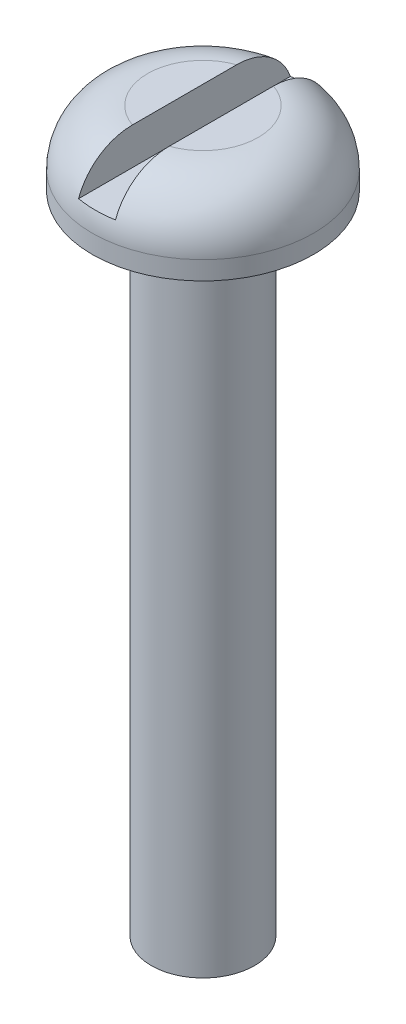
ISO-10303-21;
HEADER;
FILE_DESCRIPTION(('STEP AP214'),'2;1');
FILE_NAME('part.step','',(''),(''),'','','');
FILE_SCHEMA(('AUTOMOTIVE_DESIGN { 1 0 10303 214 1 1 1 1 }'));
ENDSEC;
DATA;
#1=APPLICATION_CONTEXT('core data for automotive mechanical design processes');
#2=APPLICATION_PROTOCOL_DEFINITION('international standard','automotive_design',2000,#1);
#3=PRODUCT_CONTEXT('',#1,'mechanical');
#4=PRODUCT('Part','Part','',(#3));
#5=PRODUCT_RELATED_PRODUCT_CATEGORY('part','',(#4));
#6=PRODUCT_DEFINITION_FORMATION('','',#4);
#7=PRODUCT_DEFINITION_CONTEXT('part definition',#1,'design');
#8=PRODUCT_DEFINITION('design','',#6,#7);
#9=PRODUCT_DEFINITION_SHAPE('','',#8);
#10=(LENGTH_UNIT() NAMED_UNIT(*) SI_UNIT(.MILLI.,.METRE.));
#11=(NAMED_UNIT(*) PLANE_ANGLE_UNIT() SI_UNIT($,.RADIAN.));
#12=(NAMED_UNIT(*) SI_UNIT($,.STERADIAN.) SOLID_ANGLE_UNIT());
#13=UNCERTAINTY_MEASURE_WITH_UNIT(LENGTH_MEASURE(1.E-05),#10,'distance_accuracy_value','');
#14=(GEOMETRIC_REPRESENTATION_CONTEXT(3) GLOBAL_UNCERTAINTY_ASSIGNED_CONTEXT((#13)) GLOBAL_UNIT_ASSIGNED_CONTEXT((#10,
#11,#12)) REPRESENTATION_CONTEXT('',''));
#15=CARTESIAN_POINT('',(0.,0.,0.));
#16=DIRECTION('',(0.,0.,1.));
#17=DIRECTION('',(1.,0.,0.));
#18=AXIS2_PLACEMENT_3D('',#15,#16,#17);
#19=CARTESIAN_POINT('',(-2.99999999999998,10.4,0.));
#20=DIRECTION('',(0.,1.,0.));
#21=DIRECTION('',(0.,0.,1.));
#22=AXIS2_PLACEMENT_3D('',#19,#20,#21);
#23=PLANE('',#22);
#24=DIRECTION('',(0.,0.,1.));
#25=VECTOR('',#24,1.);
#26=CARTESIAN_POINT('',(-1.,10.4,0.));
#27=LINE('',#26,#25);
#28=CARTESIAN_POINT('',(-1.,10.4,-2.82842712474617));
#29=VERTEX_POINT('',#28);
#30=CARTESIAN_POINT('',(-1.,10.4,2.82842712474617));
#31=VERTEX_POINT('',#30);
#32=EDGE_CURVE('E53',#29,#31,#27,.T.);
#33=ORIENTED_EDGE('',*,*,#32,.F.);
#34=CARTESIAN_POINT('',(0.,10.4,0.));
#35=DIRECTION('',(0.,1.,0.));
#36=DIRECTION('',(0.,0.,1.));
#37=AXIS2_PLACEMENT_3D('',#34,#35,#36);
#38=CIRCLE('',#37,2.99999999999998);
#39=EDGE_CURVE('E88',#29,#31,#38,.T.);
#40=ORIENTED_EDGE('',*,*,#39,.T.);
#41=EDGE_LOOP('',(#33,#40));
#42=FACE_BOUND('',#41,.T.);
#43=ADVANCED_FACE('F26',(#42),#23,.T.);
#44=CARTESIAN_POINT('',(0.,-28.6,0.));
#45=DIRECTION('',(0.,1.,0.));
#46=DIRECTION('',(0.,0.,1.));
#47=AXIS2_PLACEMENT_3D('',#44,#45,#46);
#48=CYLINDRICAL_SURFACE('',#47,2.8);
#49=CARTESIAN_POINT('',(0.,-28.6,0.));
#50=DIRECTION('',(0.,1.,0.));
#51=DIRECTION('',(0.,0.,1.));
#52=AXIS2_PLACEMENT_3D('',#49,#50,#51);
#53=CIRCLE('',#52,2.8);
#54=CARTESIAN_POINT('',(0.,-28.6,2.8));
#55=VERTEX_POINT('',#54);
#56=EDGE_CURVE('E79',#55,#55,#53,.T.);
#57=ORIENTED_EDGE('',*,*,#56,.T.);
#58=EDGE_LOOP('',(#57));
#59=FACE_BOUND('',#58,.T.);
#60=CARTESIAN_POINT('',(0.,6.4,0.));
#61=DIRECTION('',(0.,1.,0.));
#62=DIRECTION('',(0.,0.,1.));
#63=AXIS2_PLACEMENT_3D('',#60,#61,#62);
#64=CIRCLE('',#63,2.8);
#65=CARTESIAN_POINT('',(0.,6.4,2.8));
#66=VERTEX_POINT('',#65);
#67=EDGE_CURVE('E103',#66,#66,#64,.T.);
#68=ORIENTED_EDGE('',*,*,#67,.F.);
#69=EDGE_LOOP('',(#68));
#70=FACE_BOUND('',#69,.T.);
#71=ADVANCED_FACE('F28',(#59,#70),#48,.T.);
#72=CARTESIAN_POINT('',(0.,-28.6,0.));
#73=DIRECTION('',(0.,1.,0.));
#74=DIRECTION('',(0.,0.,1.));
#75=AXIS2_PLACEMENT_3D('',#72,#73,#74);
#76=PLANE('',#75);
#77=ORIENTED_EDGE('',*,*,#56,.F.);
#78=EDGE_LOOP('',(#77));
#79=FACE_BOUND('',#78,.T.);
#80=ADVANCED_FACE('F116',(#79),#76,.F.);
#81=DIRECTION('',(0.,0.,-1.));
#82=VECTOR('',#81,1.);
#83=CARTESIAN_POINT('',(1.,10.4,0.));
#84=LINE('',#83,#82);
#85=CARTESIAN_POINT('',(1.,10.4,2.82842712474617));
#86=VERTEX_POINT('',#85);
#87=CARTESIAN_POINT('',(1.,10.4,-2.82842712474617));
#88=VERTEX_POINT('',#87);
#89=EDGE_CURVE('E96',#86,#88,#84,.T.);
#90=ORIENTED_EDGE('',*,*,#89,.F.);
#91=EDGE_CURVE('E101',#86,#88,#38,.T.);
#92=ORIENTED_EDGE('',*,*,#91,.T.);
#93=EDGE_LOOP('',(#90,#92));
#94=FACE_BOUND('',#93,.T.);
#95=ADVANCED_FACE('F100',(#94),#23,.T.);
#96=CARTESIAN_POINT('',(0.,7.4,0.));
#97=DIRECTION('',(0.,1.,0.));
#98=DIRECTION('',(0.,0.,1.));
#99=AXIS2_PLACEMENT_3D('',#96,#97,#98);
#100=DEGENERATE_TOROIDAL_SURFACE('',#99,3.,3.,.T.);
#101=CARTESIAN_POINT('',(-1.,9.63606797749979,0.));
#102=CARTESIAN_POINT('',(-1.,9.63606832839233,0.0347573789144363));
#103=CARTESIAN_POINT('',(-1.,9.63770284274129,0.0695160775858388));
#104=CARTESIAN_POINT('',(-1.,9.64408287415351,0.138755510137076));
#105=CARTESIAN_POINT('',(-1.,9.6488301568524,0.173236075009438));
#106=CARTESIAN_POINT('',(-1.,9.66716719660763,0.276081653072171));
#107=CARTESIAN_POINT('',(-1.,9.68484951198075,0.343712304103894));
#108=CARTESIAN_POINT('',(-1.,9.71717923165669,0.4461027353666));
#109=CARTESIAN_POINT('',(-1.,9.72948627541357,0.48168390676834));
#110=CARTESIAN_POINT('',(-1.,9.75545837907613,0.552350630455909));
#111=CARTESIAN_POINT('',(-1.,9.76912329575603,0.587436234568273));
#112=CARTESIAN_POINT('',(-1.,9.81145913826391,0.692267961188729));
#113=CARTESIAN_POINT('',(-1.,9.84143179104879,0.761475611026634));
#114=CARTESIAN_POINT('',(-1.,9.90253859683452,0.900503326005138));
#115=CARTESIAN_POINT('',(-1.,9.93368307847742,0.970318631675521));
#116=CARTESIAN_POINT('',(-1.,9.99499645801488,1.11038321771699));
#117=CARTESIAN_POINT('',(-1.,10.0251653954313,1.18063248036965));
#118=CARTESIAN_POINT('',(-1.,10.0833182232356,1.32194271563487));
#119=CARTESIAN_POINT('',(-1.,10.1113046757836,1.39300262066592));
#120=CARTESIAN_POINT('',(-1.,10.164299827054,1.53623261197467));
#121=CARTESIAN_POINT('',(-1.,10.1893085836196,1.6084026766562));
#122=CARTESIAN_POINT('',(-1.,10.2355782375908,1.75344944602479));
#123=CARTESIAN_POINT('',(-1.,10.2568615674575,1.82631892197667));
#124=CARTESIAN_POINT('',(-1.,10.2953971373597,1.97311635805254));
#125=CARTESIAN_POINT('',(-1.,10.3126491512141,2.04704437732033));
#126=CARTESIAN_POINT('',(-1.,10.3577711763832,2.27017730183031));
#127=CARTESIAN_POINT('',(-1.,10.3790271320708,2.42079171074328));
#128=CARTESIAN_POINT('',(-1.,10.4038018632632,2.75165591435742));
#129=CARTESIAN_POINT('',(-1.,10.4033074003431,2.9322290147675));
#130=CARTESIAN_POINT('',(-1.,10.3725931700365,3.29154287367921));
#131=CARTESIAN_POINT('',(-1.,10.3422683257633,3.47027489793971));
#132=CARTESIAN_POINT('',(-1.,10.2514159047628,3.82025138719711));
#133=CARTESIAN_POINT('',(-1.,10.1908401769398,3.99148344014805));
#134=CARTESIAN_POINT('',(-1.,10.0406941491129,4.32048796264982));
#135=CARTESIAN_POINT('',(-1.,9.95116388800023,4.47827864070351));
#136=CARTESIAN_POINT('',(-1.,9.74943602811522,4.76974559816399));
#137=CARTESIAN_POINT('',(-1.,9.63823763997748,4.90411388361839));
#138=CARTESIAN_POINT('',(-1.,9.39426259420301,5.15168172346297));
#139=CARTESIAN_POINT('',(-1.,9.26148081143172,5.26487623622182));
#140=CARTESIAN_POINT('',(-1.,8.98205370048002,5.46375896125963));
#141=CARTESIAN_POINT('',(-1.,8.83587335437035,5.55010106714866));
#142=CARTESIAN_POINT('',(-1.,8.53097970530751,5.69666959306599));
#143=CARTESIAN_POINT('',(-1.,8.37226882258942,5.75690104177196));
#144=CARTESIAN_POINT('',(-1.,8.0488196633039,5.8488888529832));
#145=CARTESIAN_POINT('',(-1.,7.88417400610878,5.88097116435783));
#146=CARTESIAN_POINT('',(-1.,7.55182648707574,5.91690424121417));
#147=CARTESIAN_POINT('',(-1.,7.38412463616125,5.92075510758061));
#148=CARTESIAN_POINT('',(-1.,7.05121938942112,5.90015560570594));
#149=CARTESIAN_POINT('',(-1.,6.8860082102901,5.87583071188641));
#150=CARTESIAN_POINT('',(-1.,6.56201500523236,5.7998066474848));
#151=CARTESIAN_POINT('',(-1.,6.403232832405,5.74810810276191));
#152=CARTESIAN_POINT('',(-1.,6.09646302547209,5.61881807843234));
#153=CARTESIAN_POINT('',(-1.,5.94848281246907,5.5412089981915));
#154=CARTESIAN_POINT('',(-1.,5.66754684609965,5.36238488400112));
#155=CARTESIAN_POINT('',(-1.,5.53459196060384,5.26116848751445));
#156=CARTESIAN_POINT('',(-1.,5.28656849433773,5.0373998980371));
#157=CARTESIAN_POINT('',(-1.,5.17161437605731,4.91472090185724));
#158=CARTESIAN_POINT('',(-1.,4.96362987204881,4.65205748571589));
#159=CARTESIAN_POINT('',(-1.,4.87059580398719,4.51207597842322));
#160=CARTESIAN_POINT('',(-1.,4.70756140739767,4.21678709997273));
#161=CARTESIAN_POINT('',(-1.,4.63789724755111,4.06129462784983));
#162=CARTESIAN_POINT('',(-1.,4.52478348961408,3.74086162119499));
#163=CARTESIAN_POINT('',(-1.,4.48135615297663,3.57591319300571));
#164=CARTESIAN_POINT('',(-1.,4.43577628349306,3.32243719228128));
#165=CARTESIAN_POINT('',(-1.,4.42381973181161,3.23554798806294));
#166=CARTESIAN_POINT('',(-1.,4.40692467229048,3.06107219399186));
#167=CARTESIAN_POINT('',(-1.,4.40198614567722,2.9734856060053));
#168=CARTESIAN_POINT('',(-1.,4.39899729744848,2.79845997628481));
#169=CARTESIAN_POINT('',(-1.,4.40092695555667,2.71102124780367));
#170=CARTESIAN_POINT('',(-1.,4.4113882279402,2.53654048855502));
#171=CARTESIAN_POINT('',(-1.,4.41992057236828,2.44949850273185));
#172=CARTESIAN_POINT('',(-1.,4.44825139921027,2.23923553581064));
#173=CARTESIAN_POINT('',(-1.,4.47130585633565,2.1164462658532));
#174=CARTESIAN_POINT('',(-1.,4.52883714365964,1.87359527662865));
#175=CARTESIAN_POINT('',(-1.,4.56331696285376,1.75353427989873));
#176=CARTESIAN_POINT('',(-1.,4.62221533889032,1.5752245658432));
#177=CARTESIAN_POINT('',(-1.,4.64316696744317,1.51579395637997));
#178=CARTESIAN_POINT('',(-1.,4.68707482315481,1.3976767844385));
#179=CARTESIAN_POINT('',(-1.,4.71003106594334,1.33899022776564));
#180=CARTESIAN_POINT('',(-1.,4.75748504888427,1.22225948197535));
#181=CARTESIAN_POINT('',(-1.,4.78198258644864,1.1642152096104));
#182=CARTESIAN_POINT('',(-1.,4.83191739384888,1.04852857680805));
#183=CARTESIAN_POINT('',(-1.,4.85735476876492,0.990886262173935));
#184=CARTESIAN_POINT('',(-1.,4.90965439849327,0.872679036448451));
#185=CARTESIAN_POINT('',(-1.,4.93652245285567,0.8121167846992));
#186=CARTESIAN_POINT('',(-1.,4.98900952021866,0.69036779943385));
#187=CARTESIAN_POINT('',(-1.,5.01462730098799,0.629180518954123));
#188=CARTESIAN_POINT('',(-1.,5.06212726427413,0.506340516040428));
#189=CARTESIAN_POINT('',(-1.,5.08405778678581,0.444707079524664));
#190=CARTESIAN_POINT('',(-1.,5.12154538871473,0.31954596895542));
#191=CARTESIAN_POINT('',(-1.,5.13711852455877,0.256023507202));
#192=CARTESIAN_POINT('',(-1.,5.15343419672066,0.157569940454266));
#193=CARTESIAN_POINT('',(-1.,5.15770699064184,0.123230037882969));
#194=CARTESIAN_POINT('',(-1.,5.16313641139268,0.0542936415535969));
#195=CARTESIAN_POINT('',(-1.,5.16429281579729,0.0196971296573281));
#196=CARTESIAN_POINT('',(-1.,5.16337290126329,-0.0494804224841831));
#197=CARTESIAN_POINT('',(-1.,5.16129388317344,-0.0840614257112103));
#198=CARTESIAN_POINT('',(-1.,5.15409804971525,-0.152894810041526));
#199=CARTESIAN_POINT('',(-1.,5.14898131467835,-0.187147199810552));
#200=CARTESIAN_POINT('',(-1.,5.13015334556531,-0.286751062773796));
#201=CARTESIAN_POINT('',(-1.,5.11287417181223,-0.351418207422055));
#202=CARTESIAN_POINT('',(-1.,5.07230890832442,-0.478851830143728));
#203=CARTESIAN_POINT('',(-1.,5.04900843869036,-0.541613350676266));
#204=CARTESIAN_POINT('',(-1.,4.99913520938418,-0.66673541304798));
#205=CARTESIAN_POINT('',(-1.,4.97252384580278,-0.729080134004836));
#206=CARTESIAN_POINT('',(-1.,4.91836683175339,-0.853282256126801));
#207=CARTESIAN_POINT('',(-1.,4.89082205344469,-0.915140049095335));
#208=CARTESIAN_POINT('',(-1.,4.83624958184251,-1.0387807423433));
#209=CARTESIAN_POINT('',(-1.,4.80922021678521,-1.10056288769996));
#210=CARTESIAN_POINT('',(-1.,4.75648944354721,-1.22468685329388));
#211=CARTESIAN_POINT('',(-1.,4.73078784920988,-1.28702859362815));
#212=CARTESIAN_POINT('',(-1.,4.68138225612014,-1.41249925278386));
#213=CARTESIAN_POINT('',(-1.,4.65767803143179,-1.47562808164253));
#214=CARTESIAN_POINT('',(-1.,4.61276045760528,-1.60279691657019));
#215=CARTESIAN_POINT('',(-1.,4.59154824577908,-1.66683732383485));
#216=CARTESIAN_POINT('',(-1.,4.53266048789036,-1.85908765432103));
#217=CARTESIAN_POINT('',(-1.,4.49923620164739,-1.98864724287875));
#218=CARTESIAN_POINT('',(-1.,4.446117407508,-2.25057624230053));
#219=CARTESIAN_POINT('',(-1.,4.42641891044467,-2.38294482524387));
#220=CARTESIAN_POINT('',(-1.,4.40605842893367,-2.60646426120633));
#221=CARTESIAN_POINT('',(-1.,4.40132276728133,-2.69725619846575));
#222=CARTESIAN_POINT('',(-1.,4.39915855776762,-2.8789254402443));
#223=CARTESIAN_POINT('',(-1.,4.40172874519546,-2.96980272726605));
#224=CARTESIAN_POINT('',(-1.,4.41439313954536,-3.15129057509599));
#225=CARTESIAN_POINT('',(-1.,4.4245083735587,-3.24189967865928));
#226=CARTESIAN_POINT('',(-1.,4.45238465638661,-3.4219422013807));
#227=CARTESIAN_POINT('',(-1.,4.47014599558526,-3.511375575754));
#228=CARTESIAN_POINT('',(-1.,4.51335690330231,-3.68854041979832));
#229=CARTESIAN_POINT('',(-1.,4.53882028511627,-3.77626852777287));
#230=CARTESIAN_POINT('',(-1.,4.59734508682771,-3.94919111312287));
#231=CARTESIAN_POINT('',(-1.,4.63040939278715,-4.03438461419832));
#232=CARTESIAN_POINT('',(-1.,4.70391999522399,-4.20141723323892));
#233=CARTESIAN_POINT('',(-1.,4.74435770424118,-4.28326011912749));
#234=CARTESIAN_POINT('',(-1.,4.83237615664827,-4.44302016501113));
#235=CARTESIAN_POINT('',(-1.,4.8799594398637,-4.52093591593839));
#236=CARTESIAN_POINT('',(-1.,5.02827020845,-4.74081279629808));
#237=CARTESIAN_POINT('',(-1.,5.138074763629,-4.87681149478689));
#238=CARTESIAN_POINT('',(-1.,5.3795008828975,-5.12771781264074));
#239=CARTESIAN_POINT('',(-1.,5.51112232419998,-5.24262555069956));
#240=CARTESIAN_POINT('',(-1.,5.78847892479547,-5.44496493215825));
#241=CARTESIAN_POINT('',(-1.,5.93372445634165,-5.53306721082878));
#242=CARTESIAN_POINT('',(-1.,6.23707199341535,-5.68328014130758));
#243=CARTESIAN_POINT('',(-1.,6.39517242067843,-5.74539397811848));
#244=CARTESIAN_POINT('',(-1.,6.71768010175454,-5.84117013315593));
#245=CARTESIAN_POINT('',(-1.,6.88198785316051,-5.87516773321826));
#246=CARTESIAN_POINT('',(-1.,7.2139841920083,-5.91495403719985));
#247=CARTESIAN_POINT('',(-1.,7.38167269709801,-5.92074342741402));
#248=CARTESIAN_POINT('',(-1.,7.71484518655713,-5.90398074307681));
#249=CARTESIAN_POINT('',(-1.,7.88033578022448,-5.88155963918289));
#250=CARTESIAN_POINT('',(-1.,8.20520274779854,-5.80926441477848));
#251=CARTESIAN_POINT('',(-1.,8.36457923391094,-5.75939079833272));
#252=CARTESIAN_POINT('',(-1.,8.67280611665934,-5.63363023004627));
#253=CARTESIAN_POINT('',(-1.,8.82165106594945,-5.55772993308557));
#254=CARTESIAN_POINT('',(-1.,9.1045853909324,-5.38215097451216));
#255=CARTESIAN_POINT('',(-1.,9.23867399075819,-5.28247106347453));
#256=CARTESIAN_POINT('',(-1.,9.48917755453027,-5.06159008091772));
#257=CARTESIAN_POINT('',(-1.,9.60548349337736,-4.94026541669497));
#258=CARTESIAN_POINT('',(-1.,9.81637064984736,-4.68006511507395));
#259=CARTESIAN_POINT('',(-1.,9.91095512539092,-4.54119211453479));
#260=CARTESIAN_POINT('',(-1.,10.0772293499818,-4.24788414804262));
#261=CARTESIAN_POINT('',(-1.,10.1485929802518,-4.09326449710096));
#262=CARTESIAN_POINT('',(-1.,10.2651975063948,-3.77437481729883));
#263=CARTESIAN_POINT('',(-1.,10.3104184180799,-3.61009751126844));
#264=CARTESIAN_POINT('',(-1.,10.3751522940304,-3.27138430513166));
#265=CARTESIAN_POINT('',(-1.,10.3938375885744,-3.0967913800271));
#266=CARTESIAN_POINT('',(-1.,10.4035552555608,-2.7473165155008));
#267=CARTESIAN_POINT('',(-1.,10.3946547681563,-2.57243631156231));
#268=CARTESIAN_POINT('',(-1.,10.3580215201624,-2.27781817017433));
#269=CARTESIAN_POINT('',(-1.,10.3367107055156,-2.15721771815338));
#270=CARTESIAN_POINT('',(-1.,10.2829450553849,-1.9185127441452));
#271=CARTESIAN_POINT('',(-1.,10.2504874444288,-1.80040885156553));
#272=CARTESIAN_POINT('',(-1.,10.1759154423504,-1.56619947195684));
#273=CARTESIAN_POINT('',(-1.,10.133717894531,-1.45012102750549));
#274=CARTESIAN_POINT('',(-1.,10.0654960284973,-1.27803012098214));
#275=CARTESIAN_POINT('',(-1.,10.0419365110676,-1.22100864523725));
#276=CARTESIAN_POINT('',(-1.,9.99370728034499,-1.10742790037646));
#277=CARTESIAN_POINT('',(-1.,9.96903741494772,-1.05086869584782));
#278=CARTESIAN_POINT('',(-1.,9.91532500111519,-0.928972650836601));
#279=CARTESIAN_POINT('',(-1.,9.88621026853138,-0.863668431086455));
#280=CARTESIAN_POINT('',(-1.,9.82893394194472,-0.73252369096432));
#281=CARTESIAN_POINT('',(-1.,9.80077368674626,-0.66668256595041));
#282=CARTESIAN_POINT('',(-1.,9.74820261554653,-0.534431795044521));
#283=CARTESIAN_POINT('',(-1.,9.72374927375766,-0.468039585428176));
#284=CARTESIAN_POINT('',(-1.,9.6818989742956,-0.333081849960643));
#285=CARTESIAN_POINT('',(-1.,9.6644808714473,-0.264523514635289));
#286=CARTESIAN_POINT('',(-1.,9.64735225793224,-0.162811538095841));
#287=CARTESIAN_POINT('',(-1.,9.64315574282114,-0.130420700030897));
#288=CARTESIAN_POINT('',(-1.,9.63751175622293,-0.0653538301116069));
#289=CARTESIAN_POINT('',(-1.,9.63606764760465,-0.0326774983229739));
#290=CARTESIAN_POINT('',(-1.,9.63606797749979,0.));
#291=B_SPLINE_CURVE_WITH_KNOTS('',3,(#101,#102,#103,#104,#105,#106,#107,#108,#109,#110,#111,
#112,#113,#114,#115,#116,#117,#118,#119,#120,#121,#122,#123,#124,#125,#126,#127,#128,#129,#130,
#131,#132,#133,#134,#135,#136,#137,#138,#139,#140,#141,#142,#143,#144,#145,#146,#147,#148,#149,
#150,#151,#152,#153,#154,#155,#156,#157,#158,#159,#160,#161,#162,#163,#164,#165,#166,#167,#168,
#169,#170,#171,#172,#173,#174,#175,#176,#177,#178,#179,#180,#181,#182,#183,#184,#185,#186,#187,
#188,#189,#190,#191,#192,#193,#194,#195,#196,#197,#198,#199,#200,#201,#202,#203,#204,#205,#206,
#207,#208,#209,#210,#211,#212,#213,#214,#215,#216,#217,#218,#219,#220,#221,#222,#223,#224,#225,
#226,#227,#228,#229,#230,#231,#232,#233,#234,#235,#236,#237,#238,#239,#240,#241,#242,#243,#244,
#245,#246,#247,#248,#249,#250,#251,#252,#253,#254,#255,#256,#257,#258,#259,#260,#261,#262,#263,
#264,#265,#266,#267,#268,#269,#270,#271,#272,#273,#274,#275,#276,#277,#278,#279,#280,#281,#282,
#283,#284,#285,#286,#287,#288,#289,#290),.UNSPECIFIED.,.T.,.F.,(4,2,2,2,2,2,2,2,2,2,2,2,2,2,2,2,
2,2,2,2,2,2,2,2,2,2,2,2,2,2,2,2,2,2,2,2,2,2,2,2,2,2,2,2,2,2,2,2,2,2,2,2,2,2,2,2,2,2,2,2,2,2,2,2,
2,2,2,2,2,2,2,2,2,2,2,2,2,2,2,2,2,2,2,2,2,2,2,2,2,2,2,2,2,2,4),(0.,0.104237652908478,
0.208534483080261,0.417537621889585,0.530480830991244,0.643412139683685,0.869634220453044,
1.09898354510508,1.32832356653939,1.55739016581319,1.78645231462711,2.01408380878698,
2.2417280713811,2.69682624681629,3.23619534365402,3.77747118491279,4.31961134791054,
4.86100501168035,5.38166842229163,5.9024556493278,6.40933371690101,6.91611412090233,
7.41694580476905,7.91777569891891,8.41638380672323,8.91498051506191,9.41391660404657,
9.91288149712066,10.4149005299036,10.9168351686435,11.425707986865,11.935011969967,
12.1978990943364,12.4607855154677,12.7229062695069,12.9850560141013,13.3592114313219,
13.7334648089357,13.9224808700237,14.1114984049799,14.3004911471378,14.4895050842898,
14.6882714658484,14.8872299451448,15.0833327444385,15.2789371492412,15.3826261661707,
15.4863225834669,15.5901055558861,15.6938857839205,15.8941229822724,16.0948428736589,
16.2981722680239,16.5013166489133,16.7036178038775,16.9058905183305,17.1081403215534,
17.3104820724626,17.7112243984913,18.1118502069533,18.384330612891,18.6567638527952,
18.9299591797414,19.2031648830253,19.476863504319,19.750666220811,20.0241520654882,
20.297735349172,20.8192967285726,21.3408551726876,21.848022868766,22.3551283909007,
22.8560958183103,23.3570510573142,23.8556891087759,24.3543180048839,24.8532029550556,
25.352114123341,25.853971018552,26.3557525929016,26.8643043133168,27.3732442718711,
27.8977339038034,28.4209480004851,28.7878210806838,29.1547855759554,29.5250072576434,
29.7100892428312,29.8951966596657,30.1097037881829,30.3245002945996,30.5366077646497,
30.7480728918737,30.8459534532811,30.9439535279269),.UNSPECIFIED.);
#292=CARTESIAN_POINT('',(-1.,8.39519293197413,5.74372035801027));
#293=VERTEX_POINT('',#292);
#294=EDGE_CURVE('E11',#31,#293,#291,.T.);
#295=ORIENTED_EDGE('',*,*,#294,.F.);
#296=ORIENTED_EDGE('',*,*,#39,.F.);
#297=CARTESIAN_POINT('',(-1.,8.39519293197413,-5.74372035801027));
#298=VERTEX_POINT('',#297);
#299=EDGE_CURVE('E30',#298,#29,#291,.T.);
#300=ORIENTED_EDGE('',*,*,#299,.F.);
#301=CARTESIAN_POINT('',(0.,8.39519293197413,0.));
#302=DIRECTION('',(0.,-1.,0.));
#303=DIRECTION('',(0.,0.,-1.));
#304=AXIS2_PLACEMENT_3D('',#301,#302,#303);
#305=CIRCLE('',#304,5.83012208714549);
#306=CARTESIAN_POINT('',(1.,8.39519293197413,-5.74372035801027));
#307=VERTEX_POINT('',#306);
#308=EDGE_CURVE('E70',#307,#298,#305,.F.);
#309=ORIENTED_EDGE('',*,*,#308,.F.);
#310=CARTESIAN_POINT('',(1.,9.63606797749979,0.));
#311=CARTESIAN_POINT('',(1.,9.63606832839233,-0.0347573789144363));
#312=CARTESIAN_POINT('',(1.,9.63770284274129,-0.0695160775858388));
#313=CARTESIAN_POINT('',(1.,9.64408287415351,-0.138755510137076));
#314=CARTESIAN_POINT('',(1.,9.6488301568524,-0.173236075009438));
#315=CARTESIAN_POINT('',(1.,9.66716719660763,-0.276081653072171));
#316=CARTESIAN_POINT('',(1.,9.68484951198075,-0.343712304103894));
#317=CARTESIAN_POINT('',(1.,9.71717923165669,-0.4461027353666));
#318=CARTESIAN_POINT('',(1.,9.72948627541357,-0.48168390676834));
#319=CARTESIAN_POINT('',(1.,9.75545837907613,-0.55235063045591));
#320=CARTESIAN_POINT('',(1.,9.76912329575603,-0.587436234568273));
#321=CARTESIAN_POINT('',(1.,9.81145913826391,-0.69226796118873));
#322=CARTESIAN_POINT('',(1.,9.84143179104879,-0.761475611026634));
#323=CARTESIAN_POINT('',(1.,9.90253859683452,-0.900503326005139));
#324=CARTESIAN_POINT('',(1.,9.93368307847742,-0.970318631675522));
#325=CARTESIAN_POINT('',(1.,9.99499645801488,-1.11038321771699));
#326=CARTESIAN_POINT('',(1.,10.0251653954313,-1.18063248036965));
#327=CARTESIAN_POINT('',(1.,10.0833182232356,-1.32194271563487));
#328=CARTESIAN_POINT('',(1.,10.1113046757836,-1.39300262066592));
#329=CARTESIAN_POINT('',(1.,10.164299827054,-1.53623261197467));
#330=CARTESIAN_POINT('',(1.,10.1893085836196,-1.6084026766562));
#331=CARTESIAN_POINT('',(1.,10.2355782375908,-1.75344944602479));
#332=CARTESIAN_POINT('',(1.,10.2568615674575,-1.82631892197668));
#333=CARTESIAN_POINT('',(1.,10.2953971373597,-1.97311635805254));
#334=CARTESIAN_POINT('',(1.,10.3126491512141,-2.04704437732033));
#335=CARTESIAN_POINT('',(1.,10.3577711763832,-2.27017730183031));
#336=CARTESIAN_POINT('',(1.,10.3790271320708,-2.42079171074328));
#337=CARTESIAN_POINT('',(1.,10.4038018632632,-2.75165591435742));
#338=CARTESIAN_POINT('',(1.,10.4033074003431,-2.93222901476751));
#339=CARTESIAN_POINT('',(1.,10.3725931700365,-3.29154287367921));
#340=CARTESIAN_POINT('',(1.,10.3422683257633,-3.47027489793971));
#341=CARTESIAN_POINT('',(1.,10.2514159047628,-3.82025138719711));
#342=CARTESIAN_POINT('',(1.,10.1908401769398,-3.99148344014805));
#343=CARTESIAN_POINT('',(1.,10.0406941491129,-4.32048796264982));
#344=CARTESIAN_POINT('',(1.,9.95116388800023,-4.47827864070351));
#345=CARTESIAN_POINT('',(1.,9.74943602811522,-4.76974559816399));
#346=CARTESIAN_POINT('',(1.,9.63823763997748,-4.90411388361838));
#347=CARTESIAN_POINT('',(1.,9.39426259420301,-5.15168172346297));
#348=CARTESIAN_POINT('',(1.,9.26148081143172,-5.26487623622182));
#349=CARTESIAN_POINT('',(1.,8.98205370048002,-5.46375896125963));
#350=CARTESIAN_POINT('',(1.,8.83587335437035,-5.55010106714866));
#351=CARTESIAN_POINT('',(1.,8.53097970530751,-5.69666959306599));
#352=CARTESIAN_POINT('',(1.,8.37226882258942,-5.75690104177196));
#353=CARTESIAN_POINT('',(1.,8.0488196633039,-5.8488888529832));
#354=CARTESIAN_POINT('',(1.,7.88417400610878,-5.88097116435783));
#355=CARTESIAN_POINT('',(1.,7.55182648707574,-5.91690424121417));
#356=CARTESIAN_POINT('',(1.,7.38412463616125,-5.92075510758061));
#357=CARTESIAN_POINT('',(1.,7.05121938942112,-5.90015560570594));
#358=CARTESIAN_POINT('',(1.,6.8860082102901,-5.87583071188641));
#359=CARTESIAN_POINT('',(1.,6.56201500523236,-5.7998066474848));
#360=CARTESIAN_POINT('',(1.,6.403232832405,-5.74810810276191));
#361=CARTESIAN_POINT('',(1.,6.09646302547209,-5.61881807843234));
#362=CARTESIAN_POINT('',(1.,5.94848281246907,-5.5412089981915));
#363=CARTESIAN_POINT('',(1.,5.66754684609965,-5.36238488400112));
#364=CARTESIAN_POINT('',(1.,5.53459196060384,-5.26116848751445));
#365=CARTESIAN_POINT('',(1.,5.28656849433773,-5.0373998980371));
#366=CARTESIAN_POINT('',(1.,5.17161437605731,-4.91472090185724));
#367=CARTESIAN_POINT('',(1.,4.96362987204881,-4.6520574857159));
#368=CARTESIAN_POINT('',(1.,4.87059580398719,-4.51207597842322));
#369=CARTESIAN_POINT('',(1.,4.70756140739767,-4.21678709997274));
#370=CARTESIAN_POINT('',(1.,4.63789724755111,-4.06129462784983));
#371=CARTESIAN_POINT('',(1.,4.52478348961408,-3.74086162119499));
#372=CARTESIAN_POINT('',(1.,4.48135615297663,-3.57591319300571));
#373=CARTESIAN_POINT('',(1.,4.43577628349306,-3.32243719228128));
#374=CARTESIAN_POINT('',(1.,4.42381973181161,-3.23554798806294));
#375=CARTESIAN_POINT('',(1.,4.40692467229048,-3.06107219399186));
#376=CARTESIAN_POINT('',(1.,4.40198614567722,-2.9734856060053));
#377=CARTESIAN_POINT('',(1.,4.39899729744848,-2.79845997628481));
#378=CARTESIAN_POINT('',(1.,4.40092695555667,-2.71102124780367));
#379=CARTESIAN_POINT('',(1.,4.4113882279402,-2.53654048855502));
#380=CARTESIAN_POINT('',(1.,4.41992057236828,-2.44949850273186));
#381=CARTESIAN_POINT('',(1.,4.44825139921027,-2.23923553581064));
#382=CARTESIAN_POINT('',(1.,4.47130585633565,-2.1164462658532));
#383=CARTESIAN_POINT('',(1.,4.52883714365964,-1.87359527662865));
#384=CARTESIAN_POINT('',(1.,4.56331696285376,-1.75353427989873));
#385=CARTESIAN_POINT('',(1.,4.62221533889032,-1.57522456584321));
#386=CARTESIAN_POINT('',(1.,4.64316696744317,-1.51579395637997));
#387=CARTESIAN_POINT('',(1.,4.6870748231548,-1.3976767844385));
#388=CARTESIAN_POINT('',(1.,4.71003106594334,-1.33899022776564));
#389=CARTESIAN_POINT('',(1.,4.75748504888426,-1.22225948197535));
#390=CARTESIAN_POINT('',(1.,4.78198258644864,-1.16421520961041));
#391=CARTESIAN_POINT('',(1.,4.83191739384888,-1.04852857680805));
#392=CARTESIAN_POINT('',(1.,4.85735476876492,-0.990886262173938));
#393=CARTESIAN_POINT('',(1.,4.90965439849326,-0.872679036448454));
#394=CARTESIAN_POINT('',(1.,4.93652245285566,-0.812116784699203));
#395=CARTESIAN_POINT('',(1.,4.98900952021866,-0.690367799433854));
#396=CARTESIAN_POINT('',(1.,5.01462730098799,-0.629180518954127));
#397=CARTESIAN_POINT('',(1.,5.06212726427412,-0.506340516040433));
#398=CARTESIAN_POINT('',(1.,5.08405778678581,-0.444707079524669));
#399=CARTESIAN_POINT('',(1.,5.12154538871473,-0.319545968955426));
#400=CARTESIAN_POINT('',(1.,5.13711852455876,-0.256023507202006));
#401=CARTESIAN_POINT('',(1.,5.15343419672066,-0.157569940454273));
#402=CARTESIAN_POINT('',(1.,5.15770699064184,-0.123230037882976));
#403=CARTESIAN_POINT('',(1.,5.16313641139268,-0.054293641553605));
#404=CARTESIAN_POINT('',(1.,5.16429281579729,-0.0196971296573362));
#405=CARTESIAN_POINT('',(1.,5.16337290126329,0.0494804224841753));
#406=CARTESIAN_POINT('',(1.,5.16129388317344,0.0840614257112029));
#407=CARTESIAN_POINT('',(1.,5.15409804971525,0.152894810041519));
#408=CARTESIAN_POINT('',(1.,5.14898131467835,0.187147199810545));
#409=CARTESIAN_POINT('',(1.,5.13015334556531,0.28675106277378));
#410=CARTESIAN_POINT('',(1.,5.11287417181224,0.351418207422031));
#411=CARTESIAN_POINT('',(1.,5.07230890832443,0.478851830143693));
#412=CARTESIAN_POINT('',(1.,5.04900843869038,0.541613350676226));
#413=CARTESIAN_POINT('',(1.,4.9991352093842,0.666735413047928));
#414=CARTESIAN_POINT('',(1.,4.97252384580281,0.729080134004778));
#415=CARTESIAN_POINT('',(1.,4.91836683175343,0.85328225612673));
#416=CARTESIAN_POINT('',(1.,4.89082205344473,0.915140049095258));
#417=CARTESIAN_POINT('',(1.,4.83624958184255,1.03878074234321));
#418=CARTESIAN_POINT('',(1.,4.80922021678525,1.10056288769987));
#419=CARTESIAN_POINT('',(1.,4.75648944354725,1.22468685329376));
#420=CARTESIAN_POINT('',(1.,4.73078784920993,1.28702859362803));
#421=CARTESIAN_POINT('',(1.,4.68138225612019,1.41249925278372));
#422=CARTESIAN_POINT('',(1.,4.65767803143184,1.47562808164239));
#423=CARTESIAN_POINT('',(1.,4.61276045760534,1.60279691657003));
#424=CARTESIAN_POINT('',(1.,4.59154824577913,1.66683732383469));
#425=CARTESIAN_POINT('',(1.,4.53266048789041,1.85908765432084));
#426=CARTESIAN_POINT('',(1.,4.49923620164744,1.98864724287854));
#427=CARTESIAN_POINT('',(1.,4.44611740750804,2.2505762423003));
#428=CARTESIAN_POINT('',(1.,4.4264189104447,2.38294482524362));
#429=CARTESIAN_POINT('',(1.,4.40605842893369,2.60646426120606));
#430=CARTESIAN_POINT('',(1.,4.40132276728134,2.69725619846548));
#431=CARTESIAN_POINT('',(1.,4.39915855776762,2.87892544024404));
#432=CARTESIAN_POINT('',(1.,4.40172874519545,2.96980272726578));
#433=CARTESIAN_POINT('',(1.,4.41439313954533,3.15129057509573));
#434=CARTESIAN_POINT('',(1.,4.42450837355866,3.24189967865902));
#435=CARTESIAN_POINT('',(1.,4.45238465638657,3.42194220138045));
#436=CARTESIAN_POINT('',(1.,4.4701459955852,3.51137557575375));
#437=CARTESIAN_POINT('',(1.,4.51335690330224,3.68854041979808));
#438=CARTESIAN_POINT('',(1.,4.5388202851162,3.77626852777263));
#439=CARTESIAN_POINT('',(1.,4.59734508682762,3.94919111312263));
#440=CARTESIAN_POINT('',(1.,4.63040939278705,4.03438461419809));
#441=CARTESIAN_POINT('',(1.,4.70391999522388,4.20141723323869));
#442=CARTESIAN_POINT('',(1.,4.74435770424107,4.28326011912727));
#443=CARTESIAN_POINT('',(1.,4.83237615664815,4.44302016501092));
#444=CARTESIAN_POINT('',(1.,4.87995943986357,4.52093591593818));
#445=CARTESIAN_POINT('',(1.,5.02827020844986,4.74081279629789));
#446=CARTESIAN_POINT('',(1.,5.13807476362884,4.87681149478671));
#447=CARTESIAN_POINT('',(1.,5.37950088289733,5.12771781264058));
#448=CARTESIAN_POINT('',(1.,5.5111223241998,5.24262555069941));
#449=CARTESIAN_POINT('',(1.,5.78847892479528,5.44496493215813));
#450=CARTESIAN_POINT('',(1.,5.93372445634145,5.53306721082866));
#451=CARTESIAN_POINT('',(1.,6.23707199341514,5.68328014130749));
#452=CARTESIAN_POINT('',(1.,6.39517242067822,5.7453939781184));
#453=CARTESIAN_POINT('',(1.,6.71768010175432,5.84117013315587));
#454=CARTESIAN_POINT('',(1.,6.88198785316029,5.87516773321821));
#455=CARTESIAN_POINT('',(1.,7.21398419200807,5.91495403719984));
#456=CARTESIAN_POINT('',(1.,7.38167269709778,5.92074342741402));
#457=CARTESIAN_POINT('',(1.,7.7148451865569,5.90398074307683));
#458=CARTESIAN_POINT('',(1.,7.88033578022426,5.88155963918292));
#459=CARTESIAN_POINT('',(1.,8.20520274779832,5.80926441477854));
#460=CARTESIAN_POINT('',(1.,8.36457923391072,5.75939079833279));
#461=CARTESIAN_POINT('',(1.,8.67280611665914,5.63363023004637));
#462=CARTESIAN_POINT('',(1.,8.82165106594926,5.55772993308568));
#463=CARTESIAN_POINT('',(1.,9.10458539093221,5.38215097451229));
#464=CARTESIAN_POINT('',(1.,9.23867399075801,5.28247106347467));
#465=CARTESIAN_POINT('',(1.,9.48917755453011,5.06159008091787));
#466=CARTESIAN_POINT('',(1.,9.60548349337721,4.94026541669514));
#467=CARTESIAN_POINT('',(1.,9.81637064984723,4.68006511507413));
#468=CARTESIAN_POINT('',(1.,9.9109551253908,4.54119211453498));
#469=CARTESIAN_POINT('',(1.,10.0772293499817,4.24788414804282));
#470=CARTESIAN_POINT('',(1.,10.1485929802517,4.09326449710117));
#471=CARTESIAN_POINT('',(1.,10.2651975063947,3.77437481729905));
#472=CARTESIAN_POINT('',(1.,10.3104184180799,3.61009751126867));
#473=CARTESIAN_POINT('',(1.,10.3751522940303,3.2713843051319));
#474=CARTESIAN_POINT('',(1.,10.3938375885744,3.09679138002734));
#475=CARTESIAN_POINT('',(1.,10.4035552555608,2.74731651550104));
#476=CARTESIAN_POINT('',(1.,10.3946547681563,2.57243631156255));
#477=CARTESIAN_POINT('',(1.,10.3580215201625,2.27781817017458));
#478=CARTESIAN_POINT('',(1.,10.3367107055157,2.15721771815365));
#479=CARTESIAN_POINT('',(1.,10.282945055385,1.9185127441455));
#480=CARTESIAN_POINT('',(1.,10.2504874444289,1.80040885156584));
#481=CARTESIAN_POINT('',(1.,10.1759154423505,1.56619947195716));
#482=CARTESIAN_POINT('',(1.,10.1337178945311,1.45012102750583));
#483=CARTESIAN_POINT('',(1.,10.0654960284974,1.2780301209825));
#484=CARTESIAN_POINT('',(1.,10.0419365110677,1.22100864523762));
#485=CARTESIAN_POINT('',(1.,9.99370728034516,1.10742790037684));
#486=CARTESIAN_POINT('',(1.,9.96903741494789,1.0508686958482));
#487=CARTESIAN_POINT('',(1.,9.91532500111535,0.928972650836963));
#488=CARTESIAN_POINT('',(1.,9.88621026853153,0.863668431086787));
#489=CARTESIAN_POINT('',(1.,9.82893394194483,0.732523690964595));
#490=CARTESIAN_POINT('',(1.,9.80077368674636,0.666682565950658));
#491=CARTESIAN_POINT('',(1.,9.7482026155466,0.534431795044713));
#492=CARTESIAN_POINT('',(1.,9.72374927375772,0.468039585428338));
#493=CARTESIAN_POINT('',(1.,9.68189897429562,0.333081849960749));
#494=CARTESIAN_POINT('',(1.,9.66448087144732,0.264523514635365));
#495=CARTESIAN_POINT('',(1.,9.64735225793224,0.16281153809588));
#496=CARTESIAN_POINT('',(1.,9.64315574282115,0.130420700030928));
#497=CARTESIAN_POINT('',(1.,9.63751175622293,0.0653538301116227));
#498=CARTESIAN_POINT('',(1.,9.63606764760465,0.0326774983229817));
#499=CARTESIAN_POINT('',(1.,9.63606797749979,0.));
#500=B_SPLINE_CURVE_WITH_KNOTS('',3,(#310,#311,#312,#313,#314,#315,#316,#317,#318,#319,#320,
#321,#322,#323,#324,#325,#326,#327,#328,#329,#330,#331,#332,#333,#334,#335,#336,#337,#338,#339,
#340,#341,#342,#343,#344,#345,#346,#347,#348,#349,#350,#351,#352,#353,#354,#355,#356,#357,#358,
#359,#360,#361,#362,#363,#364,#365,#366,#367,#368,#369,#370,#371,#372,#373,#374,#375,#376,#377,
#378,#379,#380,#381,#382,#383,#384,#385,#386,#387,#388,#389,#390,#391,#392,#393,#394,#395,#396,
#397,#398,#399,#400,#401,#402,#403,#404,#405,#406,#407,#408,#409,#410,#411,#412,#413,#414,#415,
#416,#417,#418,#419,#420,#421,#422,#423,#424,#425,#426,#427,#428,#429,#430,#431,#432,#433,#434,
#435,#436,#437,#438,#439,#440,#441,#442,#443,#444,#445,#446,#447,#448,#449,#450,#451,#452,#453,
#454,#455,#456,#457,#458,#459,#460,#461,#462,#463,#464,#465,#466,#467,#468,#469,#470,#471,#472,
#473,#474,#475,#476,#477,#478,#479,#480,#481,#482,#483,#484,#485,#486,#487,#488,#489,#490,#491,
#492,#493,#494,#495,#496,#497,#498,#499),.UNSPECIFIED.,.T.,.F.,(4,2,2,2,2,2,2,2,2,2,2,2,2,2,2,2,
2,2,2,2,2,2,2,2,2,2,2,2,2,2,2,2,2,2,2,2,2,2,2,2,2,2,2,2,2,2,2,2,2,2,2,2,2,2,2,2,2,2,2,2,2,2,2,2,
2,2,2,2,2,2,2,2,2,2,2,2,2,2,2,2,2,2,2,2,2,2,2,2,2,2,2,2,2,2,4),(0.,0.104237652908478,
0.208534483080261,0.417537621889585,0.530480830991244,0.643412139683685,0.869634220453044,
1.09898354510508,1.32832356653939,1.55739016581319,1.78645231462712,2.01408380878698,
2.2417280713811,2.69682624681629,3.23619534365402,3.77747118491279,4.31961134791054,
4.86100501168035,5.38166842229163,5.9024556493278,6.40933371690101,6.91611412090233,
7.41694580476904,7.91777569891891,8.41638380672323,8.91498051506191,9.41391660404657,
9.91288149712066,10.4149005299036,10.9168351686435,11.425707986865,11.935011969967,
12.1978990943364,12.4607855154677,12.7229062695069,12.9850560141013,13.3592114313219,
13.7334648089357,13.9224808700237,14.1114984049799,14.3004911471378,14.4895050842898,
14.6882714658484,14.8872299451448,15.0833327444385,15.2789371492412,15.3826261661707,
15.4863225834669,15.5901055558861,15.6938857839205,15.8941229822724,16.0948428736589,
16.2981722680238,16.5013166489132,16.7036178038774,16.9058905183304,17.1081403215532,
17.3104820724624,17.7112243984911,18.111850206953,18.3843306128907,18.6567638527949,
18.9299591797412,19.2031648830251,19.4768635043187,19.7506662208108,20.024152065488,
20.2977353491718,20.8192967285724,21.3408551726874,21.8480228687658,22.3551283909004,
22.8560958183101,23.357051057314,23.8556891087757,24.3543180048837,24.8532029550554,
25.3521141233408,25.8539710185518,26.3557525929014,26.8643043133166,27.3732442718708,
27.8977339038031,28.4209480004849,28.7878210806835,29.1547855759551,29.525007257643,
29.7100892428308,29.8951966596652,30.1097037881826,30.3245002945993,30.5366077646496,
30.7480728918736,30.8459534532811,30.9439535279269),.UNSPECIFIED.);
#501=EDGE_CURVE('E78',#88,#307,#500,.T.);
#502=ORIENTED_EDGE('',*,*,#501,.F.);
#503=ORIENTED_EDGE('',*,*,#91,.F.);
#504=CARTESIAN_POINT('',(1.,8.39519293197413,5.74372035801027));
#505=VERTEX_POINT('',#504);
#506=EDGE_CURVE('E39',#505,#86,#500,.T.);
#507=ORIENTED_EDGE('',*,*,#506,.F.);
#508=EDGE_CURVE('E81',#293,#505,#305,.F.);
#509=ORIENTED_EDGE('',*,*,#508,.F.);
#510=EDGE_LOOP('',(#295,#296,#300,#309,#502,#503,#507,#509));
#511=FACE_BOUND('',#510,.T.);
#512=CARTESIAN_POINT('',(0.,7.39999999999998,0.));
#513=DIRECTION('',(0.,1.,0.));
#514=DIRECTION('',(0.,0.,1.));
#515=AXIS2_PLACEMENT_3D('',#512,#513,#514);
#516=CIRCLE('',#515,6.);
#517=CARTESIAN_POINT('',(0.,7.39999999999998,6.));
#518=VERTEX_POINT('',#517);
#519=EDGE_CURVE('E107',#518,#518,#516,.T.);
#520=ORIENTED_EDGE('',*,*,#519,.T.);
#521=EDGE_LOOP('',(#520));
#522=FACE_BOUND('',#521,.T.);
#523=ADVANCED_FACE('F85',(#511,#522),#100,.T.);
#524=CARTESIAN_POINT('',(0.,12.,0.));
#525=DIRECTION('',(0.,1.,0.));
#526=DIRECTION('',(0.,0.,1.));
#527=AXIS2_PLACEMENT_3D('',#524,#525,#526);
#528=CYLINDRICAL_SURFACE('',#527,6.);
#529=CARTESIAN_POINT('',(0.,6.4,0.));
#530=DIRECTION('',(0.,1.,0.));
#531=DIRECTION('',(0.,0.,1.));
#532=AXIS2_PLACEMENT_3D('',#529,#530,#531);
#533=CIRCLE('',#532,6.);
#534=CARTESIAN_POINT('',(0.,6.4,6.));
#535=VERTEX_POINT('',#534);
#536=EDGE_CURVE('E184',#535,#535,#533,.T.);
#537=ORIENTED_EDGE('',*,*,#536,.T.);
#538=EDGE_LOOP('',(#537));
#539=FACE_BOUND('',#538,.T.);
#540=ORIENTED_EDGE('',*,*,#519,.F.);
#541=EDGE_LOOP('',(#540));
#542=FACE_BOUND('',#541,.T.);
#543=ADVANCED_FACE('F132',(#539,#542),#528,.T.);
#544=CARTESIAN_POINT('',(-6.,6.4,0.));
#545=DIRECTION('',(0.,-1.,0.));
#546=DIRECTION('',(0.,0.,-1.));
#547=AXIS2_PLACEMENT_3D('',#544,#545,#546);
#548=PLANE('',#547);
#549=ORIENTED_EDGE('',*,*,#67,.T.);
#550=EDGE_LOOP('',(#549));
#551=FACE_BOUND('',#550,.T.);
#552=ORIENTED_EDGE('',*,*,#536,.F.);
#553=EDGE_LOOP('',(#552));
#554=FACE_BOUND('',#553,.T.);
#555=ADVANCED_FACE('F135',(#551,#554),#548,.T.);
#556=CARTESIAN_POINT('',(-1.,8.39519293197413,-6.5));
#557=DIRECTION('',(-1.,0.,0.));
#558=DIRECTION('',(0.,-1.,0.));
#559=AXIS2_PLACEMENT_3D('',#556,#557,#558);
#560=PLANE('',#559);
#561=ORIENTED_EDGE('',*,*,#294,.T.);
#562=DIRECTION('',(0.,0.,1.));
#563=VECTOR('',#562,1.);
#564=CARTESIAN_POINT('',(-1.,8.39519293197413,-6.5));
#565=LINE('',#564,#563);
#566=EDGE_CURVE('E73',#298,#293,#565,.T.);
#567=ORIENTED_EDGE('',*,*,#566,.F.);
#568=ORIENTED_EDGE('',*,*,#299,.T.);
#569=ORIENTED_EDGE('',*,*,#32,.T.);
#570=EDGE_LOOP('',(#561,#567,#568,#569));
#571=FACE_BOUND('',#570,.T.);
#572=ADVANCED_FACE('F82',(#571),#560,.F.);
#573=CARTESIAN_POINT('',(1.,8.39519293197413,-6.5));
#574=DIRECTION('',(1.,0.,0.));
#575=DIRECTION('',(0.,0.,-1.));
#576=AXIS2_PLACEMENT_3D('',#573,#574,#575);
#577=PLANE('',#576);
#578=ORIENTED_EDGE('',*,*,#501,.T.);
#579=DIRECTION('',(0.,0.,1.));
#580=VECTOR('',#579,1.);
#581=CARTESIAN_POINT('',(1.,8.39519293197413,-6.5));
#582=LINE('',#581,#580);
#583=EDGE_CURVE('E46',#307,#505,#582,.T.);
#584=ORIENTED_EDGE('',*,*,#583,.T.);
#585=ORIENTED_EDGE('',*,*,#506,.T.);
#586=ORIENTED_EDGE('',*,*,#89,.T.);
#587=EDGE_LOOP('',(#578,#584,#585,#586));
#588=FACE_BOUND('',#587,.T.);
#589=ADVANCED_FACE('F95',(#588),#577,.F.);
#590=CARTESIAN_POINT('',(-1.,8.39519293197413,-6.5));
#591=DIRECTION('',(0.,-1.,0.));
#592=DIRECTION('',(0.,0.,-1.));
#593=AXIS2_PLACEMENT_3D('',#590,#591,#592);
#594=PLANE('',#593);
#595=ORIENTED_EDGE('',*,*,#508,.T.);
#596=ORIENTED_EDGE('',*,*,#583,.F.);
#597=ORIENTED_EDGE('',*,*,#308,.T.);
#598=ORIENTED_EDGE('',*,*,#566,.T.);
#599=EDGE_LOOP('',(#595,#596,#597,#598));
#600=FACE_BOUND('',#599,.T.);
#601=ADVANCED_FACE('F72',(#600),#594,.F.);
#602=CLOSED_SHELL('',(#43,#71,#80,#95,#523,#543,#555,#572,#589,#601));
#603=MANIFOLD_SOLID_BREP('B2',#602);
#604=ADVANCED_BREP_SHAPE_REPRESENTATION('',(#18,#603),#14);
#605=SHAPE_DEFINITION_REPRESENTATION(#9,#604);
ENDSEC;
END-ISO-10303-21;
